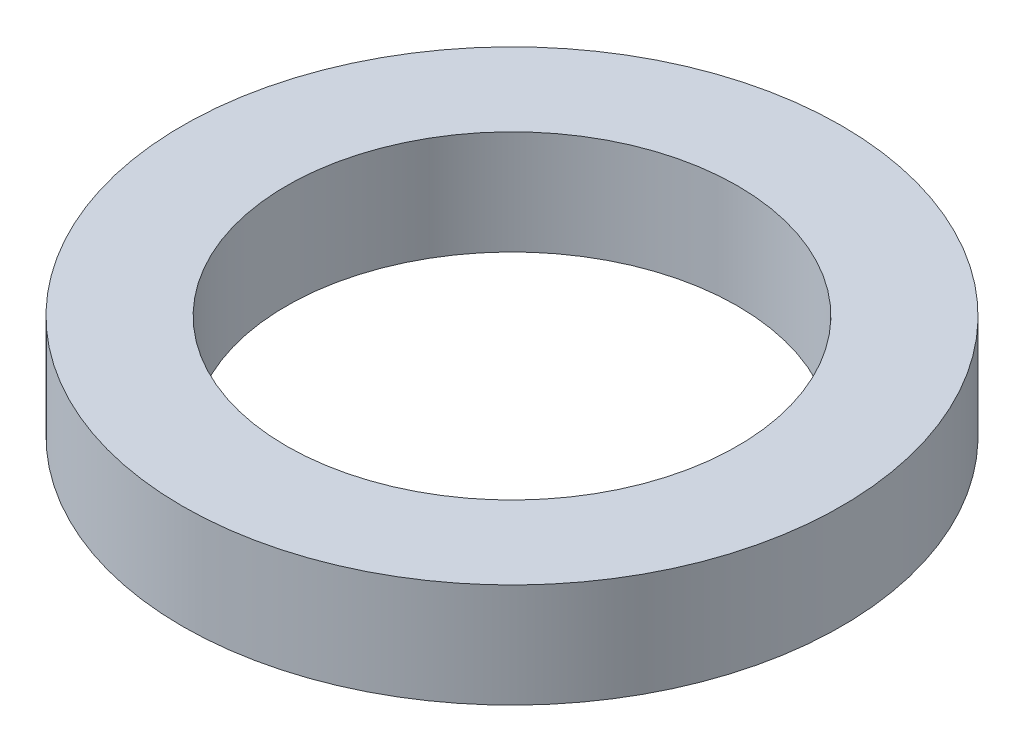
from build123d import *

# Parameters (mm, degrees)
SKETCH1_W = 0.762
SKETCH1_H = 0.762


with BuildPart() as part:
    # Sketch1 → Revolve1 (revolve)
    with BuildSketch(Plane.XY, mode=Mode.PRIVATE) as revolve1_sk:
        with Locations((-2.032, 0.381)):
            Rectangle(SKETCH1_W, SKETCH1_H)
    revolve(revolve1_sk.sketch.rotate(Axis((0, 0, 0), (0, 1, 0)), 270), axis=Axis((0, 0, 0), (0, 1, 0)))


solid = part.part
